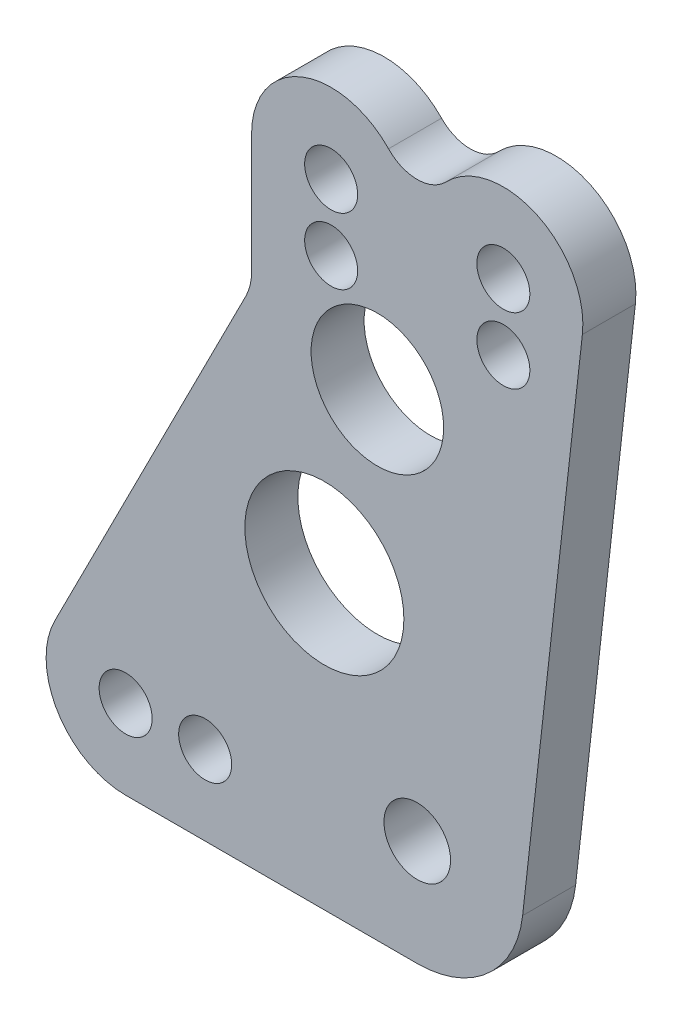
from build123d import *

# Parameters (mm, degrees)
SKETCH2_R           = 3.175
SKETCH2_R_2         = 3.9878
SKETCH2_R_3         = 9.525
SKETCH2_R_4         = 7.9375
BOSS_EXTRUDE1_DEPTH = 6.35
SKETCH5_R           = 3.175
CUT_EXTRUDE1_DEPTH  = 7.62
FILLET1_R           = 6.35


with BuildPart() as part:
    # Sketch2 → Boss-Extrude1 (new body)
    with BuildSketch(Plane.XY):
        with BuildLine():
            Line((-34.925, -12.7), (0, -12.7))
            ThreePointArc((0, -12.7), (8.465341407, -9.467206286), (12.620965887, -1.41464486))
            Line((12.620965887, -1.41464486), (19.778124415, 62.439016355))
            ThreePointArc((19.778124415, 62.439016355), (14.35244481, 72.125755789), (3.437466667, 70.092489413))
            ThreePointArc((3.437466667, 70.092489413), (0, 68.62623412), (-3.437466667, 70.092489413))
            ThreePointArc((-3.437466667, 70.092489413), (-13.864996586, 72.337685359), (-19.8374, 63.5))
            Line((-19.8374, 63.5), (-19.8374, 47.625))
            Line((-19.8374, 47.625), (-43.419668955, 1.13385418))
            ThreePointArc((-43.419668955, 1.13385418), (-43.041879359, -8.15916437), (-34.925, -12.7))
        make_face()
        with Locations((10.3124, 63.5)):
            Circle(SKETCH2_R, mode=Mode.SUBTRACT)
        with Locations((-10.3124, 63.5)):
            Circle(SKETCH2_R, mode=Mode.SUBTRACT)
        Circle(SKETCH2_R_2, mode=Mode.SUBTRACT)
        with Locations((-34.925, -3.175)):
            Circle(SKETCH2_R, mode=Mode.SUBTRACT)
        with Locations((-25.4, -3.175)):
            Circle(SKETCH2_R, mode=Mode.SUBTRACT)
        with Locations((-11.1252, 22.225)):
            Circle(SKETCH2_R_3, mode=Mode.SUBTRACT)
        with Locations((-4.7752, 44.45)):
            Circle(SKETCH2_R_4, mode=Mode.SUBTRACT)
    extrude(amount=BOSS_EXTRUDE1_DEPTH)

    # Sketch5 → Cut-Extrude1 (cut)
    with BuildSketch(Plane.XY):
        with Locations(Location((10.3124, 55.5752, 0), (0, 0, 180))):
            Circle(SKETCH5_R)
        with Locations(Location((-10.3124, 55.5752, 0), (0, 0, 180))):
            Circle(SKETCH5_R)
    extrude(amount=CUT_EXTRUDE1_DEPTH, mode=Mode.SUBTRACT)

    # Fillet1
    fillet1_edges = [part.edges().sort_by_distance(p)[0] for p in [
        (-19.8374, 47.625, 3.175),
    ]]
    fillet(fillet1_edges, radius=FILLET1_R)


solid = part.part
